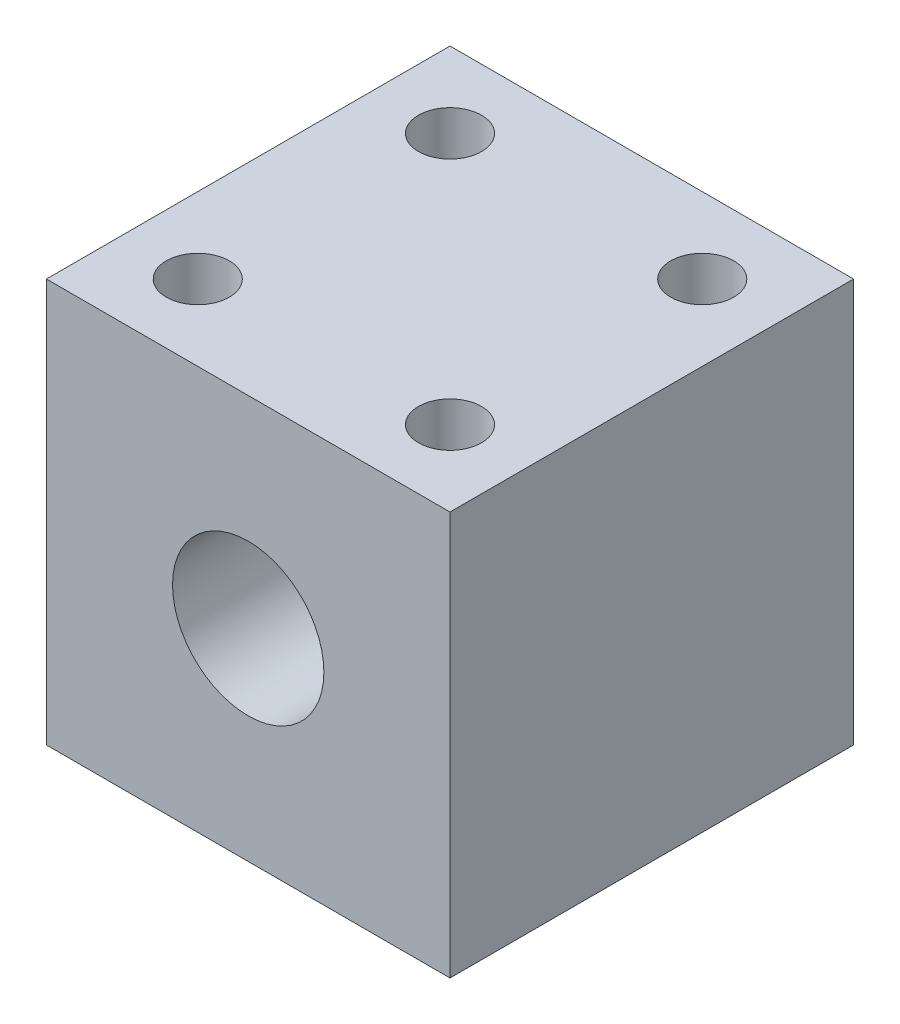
ISO-10303-21;
HEADER;
FILE_DESCRIPTION(('STEP AP214'),'2;1');
FILE_NAME('part.step','',(''),(''),'','','');
FILE_SCHEMA(('AUTOMOTIVE_DESIGN { 1 0 10303 214 1 1 1 1 }'));
ENDSEC;
DATA;
#1=APPLICATION_CONTEXT('core data for automotive mechanical design processes');
#2=APPLICATION_PROTOCOL_DEFINITION('international standard','automotive_design',2000,#1);
#3=PRODUCT_CONTEXT('',#1,'mechanical');
#4=PRODUCT('Part','Part','',(#3));
#5=PRODUCT_RELATED_PRODUCT_CATEGORY('part','',(#4));
#6=PRODUCT_DEFINITION_FORMATION('','',#4);
#7=PRODUCT_DEFINITION_CONTEXT('part definition',#1,'design');
#8=PRODUCT_DEFINITION('design','',#6,#7);
#9=PRODUCT_DEFINITION_SHAPE('','',#8);
#10=(LENGTH_UNIT() NAMED_UNIT(*) SI_UNIT(.MILLI.,.METRE.));
#11=(NAMED_UNIT(*) PLANE_ANGLE_UNIT() SI_UNIT($,.RADIAN.));
#12=(NAMED_UNIT(*) SI_UNIT($,.STERADIAN.) SOLID_ANGLE_UNIT());
#13=UNCERTAINTY_MEASURE_WITH_UNIT(LENGTH_MEASURE(1.E-05),#10,'distance_accuracy_value','');
#14=(GEOMETRIC_REPRESENTATION_CONTEXT(3) GLOBAL_UNCERTAINTY_ASSIGNED_CONTEXT((#13)) GLOBAL_UNIT_ASSIGNED_CONTEXT((#10,
#11,#12)) REPRESENTATION_CONTEXT('',''));
#15=CARTESIAN_POINT('',(0.,0.,0.));
#16=DIRECTION('',(0.,0.,1.));
#17=DIRECTION('',(1.,0.,0.));
#18=AXIS2_PLACEMENT_3D('',#15,#16,#17);
#19=CARTESIAN_POINT('',(8.,-8.,16.));
#20=DIRECTION('',(-1.,0.,0.));
#21=DIRECTION('',(0.,0.,1.));
#22=AXIS2_PLACEMENT_3D('',#19,#20,#21);
#23=PLANE('',#22);
#24=DIRECTION('',(0.,1.,0.));
#25=VECTOR('',#24,1.);
#26=CARTESIAN_POINT('',(8.,-8.,0.));
#27=LINE('',#26,#25);
#28=CARTESIAN_POINT('',(8.,-8.,0.));
#29=VERTEX_POINT('',#28);
#30=CARTESIAN_POINT('',(8.,8.,0.));
#31=VERTEX_POINT('',#30);
#32=EDGE_CURVE('E101',#29,#31,#27,.T.);
#33=ORIENTED_EDGE('',*,*,#32,.T.);
#34=DIRECTION('',(0.,0.,-1.));
#35=VECTOR('',#34,1.);
#36=CARTESIAN_POINT('',(8.,8.,16.));
#37=LINE('',#36,#35);
#38=CARTESIAN_POINT('',(8.,8.,16.));
#39=VERTEX_POINT('',#38);
#40=EDGE_CURVE('E11',#39,#31,#37,.T.);
#41=ORIENTED_EDGE('',*,*,#40,.F.);
#42=DIRECTION('',(0.,1.,0.));
#43=VECTOR('',#42,1.);
#44=CARTESIAN_POINT('',(8.,-8.,16.));
#45=LINE('',#44,#43);
#46=CARTESIAN_POINT('',(8.,-8.,16.));
#47=VERTEX_POINT('',#46);
#48=EDGE_CURVE('E89',#47,#39,#45,.T.);
#49=ORIENTED_EDGE('',*,*,#48,.F.);
#50=DIRECTION('',(0.,0.,-1.));
#51=VECTOR('',#50,1.);
#52=CARTESIAN_POINT('',(8.,-8.,16.));
#53=LINE('',#52,#51);
#54=EDGE_CURVE('E97',#47,#29,#53,.T.);
#55=ORIENTED_EDGE('',*,*,#54,.T.);
#56=EDGE_LOOP('',(#33,#41,#49,#55));
#57=FACE_BOUND('',#56,.T.);
#58=ADVANCED_FACE('F38',(#57),#23,.F.);
#59=CARTESIAN_POINT('',(-8.,8.,16.));
#60=DIRECTION('',(0.,-1.,0.));
#61=DIRECTION('',(0.,0.,-1.));
#62=AXIS2_PLACEMENT_3D('',#59,#60,#61);
#63=PLANE('',#62);
#64=CARTESIAN_POINT('',(-5.,8.00000000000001,3.));
#65=DIRECTION('',(0.,1.,0.));
#66=DIRECTION('',(0.,0.,1.));
#67=AXIS2_PLACEMENT_3D('',#64,#65,#66);
#68=CIRCLE('',#67,1.24999999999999);
#69=CARTESIAN_POINT('',(-5.,8.00000000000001,4.24999999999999));
#70=VERTEX_POINT('',#69);
#71=EDGE_CURVE('E141',#70,#70,#68,.T.);
#72=ORIENTED_EDGE('',*,*,#71,.F.);
#73=EDGE_LOOP('',(#72));
#74=FACE_BOUND('',#73,.T.);
#75=CARTESIAN_POINT('',(5.,8.00000000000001,3.));
#76=DIRECTION('',(0.,1.,0.));
#77=DIRECTION('',(0.,0.,1.));
#78=AXIS2_PLACEMENT_3D('',#75,#76,#77);
#79=CIRCLE('',#78,1.24999999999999);
#80=CARTESIAN_POINT('',(5.,8.00000000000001,4.24999999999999));
#81=VERTEX_POINT('',#80);
#82=EDGE_CURVE('E135',#81,#81,#79,.T.);
#83=ORIENTED_EDGE('',*,*,#82,.F.);
#84=EDGE_LOOP('',(#83));
#85=FACE_BOUND('',#84,.T.);
#86=CARTESIAN_POINT('',(5.,8.00000000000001,13.));
#87=DIRECTION('',(0.,1.,0.));
#88=DIRECTION('',(0.,0.,1.));
#89=AXIS2_PLACEMENT_3D('',#86,#87,#88);
#90=CIRCLE('',#89,1.24999999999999);
#91=CARTESIAN_POINT('',(5.,8.00000000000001,14.25));
#92=VERTEX_POINT('',#91);
#93=EDGE_CURVE('E129',#92,#92,#90,.T.);
#94=ORIENTED_EDGE('',*,*,#93,.F.);
#95=EDGE_LOOP('',(#94));
#96=FACE_BOUND('',#95,.T.);
#97=CARTESIAN_POINT('',(-5.,8.00000000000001,13.));
#98=DIRECTION('',(0.,1.,0.));
#99=DIRECTION('',(0.,0.,1.));
#100=AXIS2_PLACEMENT_3D('',#97,#98,#99);
#101=CIRCLE('',#100,1.24999999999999);
#102=CARTESIAN_POINT('',(-5.,8.00000000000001,14.25));
#103=VERTEX_POINT('',#102);
#104=EDGE_CURVE('E123',#103,#103,#101,.T.);
#105=ORIENTED_EDGE('',*,*,#104,.F.);
#106=EDGE_LOOP('',(#105));
#107=FACE_BOUND('',#106,.T.);
#108=DIRECTION('',(-1.,0.,0.));
#109=VECTOR('',#108,1.);
#110=CARTESIAN_POINT('',(-8.,8.,0.));
#111=LINE('',#110,#109);
#112=CARTESIAN_POINT('',(-8.,8.,0.));
#113=VERTEX_POINT('',#112);
#114=EDGE_CURVE('E93',#31,#113,#111,.T.);
#115=ORIENTED_EDGE('',*,*,#114,.T.);
#116=DIRECTION('',(0.,0.,-1.));
#117=VECTOR('',#116,1.);
#118=CARTESIAN_POINT('',(-8.,8.,16.));
#119=LINE('',#118,#117);
#120=CARTESIAN_POINT('',(-8.,8.,16.));
#121=VERTEX_POINT('',#120);
#122=EDGE_CURVE('E46',#121,#113,#119,.T.);
#123=ORIENTED_EDGE('',*,*,#122,.F.);
#124=DIRECTION('',(-1.,0.,0.));
#125=VECTOR('',#124,1.);
#126=CARTESIAN_POINT('',(-8.,8.,16.));
#127=LINE('',#126,#125);
#128=EDGE_CURVE('E84',#39,#121,#127,.T.);
#129=ORIENTED_EDGE('',*,*,#128,.F.);
#130=ORIENTED_EDGE('',*,*,#40,.T.);
#131=EDGE_LOOP('',(#115,#123,#129,#130));
#132=FACE_BOUND('',#131,.T.);
#133=ADVANCED_FACE('F92',(#74,#85,#96,#107,#132),#63,.F.);
#134=CARTESIAN_POINT('',(-8.,-8.,16.));
#135=DIRECTION('',(1.,0.,0.));
#136=DIRECTION('',(0.,0.,-1.));
#137=AXIS2_PLACEMENT_3D('',#134,#135,#136);
#138=PLANE('',#137);
#139=DIRECTION('',(0.,-1.,0.));
#140=VECTOR('',#139,1.);
#141=CARTESIAN_POINT('',(-8.,-8.,0.));
#142=LINE('',#141,#140);
#143=CARTESIAN_POINT('',(-8.,-8.,0.));
#144=VERTEX_POINT('',#143);
#145=EDGE_CURVE('E71',#113,#144,#142,.T.);
#146=ORIENTED_EDGE('',*,*,#145,.T.);
#147=DIRECTION('',(0.,0.,-1.));
#148=VECTOR('',#147,1.);
#149=CARTESIAN_POINT('',(-8.,-8.,16.));
#150=LINE('',#149,#148);
#151=CARTESIAN_POINT('',(-8.,-8.,16.));
#152=VERTEX_POINT('',#151);
#153=EDGE_CURVE('E94',#152,#144,#150,.T.);
#154=ORIENTED_EDGE('',*,*,#153,.F.);
#155=DIRECTION('',(0.,-1.,0.));
#156=VECTOR('',#155,1.);
#157=CARTESIAN_POINT('',(-8.,-8.,16.));
#158=LINE('',#157,#156);
#159=EDGE_CURVE('E87',#121,#152,#158,.T.);
#160=ORIENTED_EDGE('',*,*,#159,.F.);
#161=ORIENTED_EDGE('',*,*,#122,.T.);
#162=EDGE_LOOP('',(#146,#154,#160,#161));
#163=FACE_BOUND('',#162,.T.);
#164=ADVANCED_FACE('F95',(#163),#138,.F.);
#165=CARTESIAN_POINT('',(-8.,-8.,16.));
#166=DIRECTION('',(0.,1.,0.));
#167=DIRECTION('',(0.,0.,1.));
#168=AXIS2_PLACEMENT_3D('',#165,#166,#167);
#169=PLANE('',#168);
#170=CARTESIAN_POINT('',(-5.,-8.,3.));
#171=DIRECTION('',(0.,1.,0.));
#172=DIRECTION('',(0.,0.,1.));
#173=AXIS2_PLACEMENT_3D('',#170,#171,#172);
#174=CIRCLE('',#173,1.24999999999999);
#175=CARTESIAN_POINT('',(-5.,-8.,4.24999999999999));
#176=VERTEX_POINT('',#175);
#177=EDGE_CURVE('E138',#176,#176,#174,.T.);
#178=ORIENTED_EDGE('',*,*,#177,.T.);
#179=EDGE_LOOP('',(#178));
#180=FACE_BOUND('',#179,.T.);
#181=CARTESIAN_POINT('',(5.,-8.,3.));
#182=DIRECTION('',(0.,1.,0.));
#183=DIRECTION('',(0.,0.,1.));
#184=AXIS2_PLACEMENT_3D('',#181,#182,#183);
#185=CIRCLE('',#184,1.24999999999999);
#186=CARTESIAN_POINT('',(5.,-8.,4.24999999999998));
#187=VERTEX_POINT('',#186);
#188=EDGE_CURVE('E132',#187,#187,#185,.T.);
#189=ORIENTED_EDGE('',*,*,#188,.T.);
#190=EDGE_LOOP('',(#189));
#191=FACE_BOUND('',#190,.T.);
#192=CARTESIAN_POINT('',(5.,-8.,13.));
#193=DIRECTION('',(0.,1.,0.));
#194=DIRECTION('',(0.,0.,1.));
#195=AXIS2_PLACEMENT_3D('',#192,#193,#194);
#196=CIRCLE('',#195,1.24999999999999);
#197=CARTESIAN_POINT('',(5.,-8.,14.25));
#198=VERTEX_POINT('',#197);
#199=EDGE_CURVE('E126',#198,#198,#196,.T.);
#200=ORIENTED_EDGE('',*,*,#199,.T.);
#201=EDGE_LOOP('',(#200));
#202=FACE_BOUND('',#201,.T.);
#203=CARTESIAN_POINT('',(-5.,-8.,13.));
#204=DIRECTION('',(0.,1.,0.));
#205=DIRECTION('',(0.,0.,1.));
#206=AXIS2_PLACEMENT_3D('',#203,#204,#205);
#207=CIRCLE('',#206,1.24999999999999);
#208=CARTESIAN_POINT('',(-5.,-8.,14.25));
#209=VERTEX_POINT('',#208);
#210=EDGE_CURVE('E118',#209,#209,#207,.T.);
#211=ORIENTED_EDGE('',*,*,#210,.T.);
#212=EDGE_LOOP('',(#211));
#213=FACE_BOUND('',#212,.T.);
#214=DIRECTION('',(1.,0.,0.));
#215=VECTOR('',#214,1.);
#216=CARTESIAN_POINT('',(-8.,-8.,0.));
#217=LINE('',#216,#215);
#218=EDGE_CURVE('E77',#144,#29,#217,.T.);
#219=ORIENTED_EDGE('',*,*,#218,.T.);
#220=ORIENTED_EDGE('',*,*,#54,.F.);
#221=DIRECTION('',(1.,0.,0.));
#222=VECTOR('',#221,1.);
#223=CARTESIAN_POINT('',(-8.,-8.,16.));
#224=LINE('',#223,#222);
#225=EDGE_CURVE('E54',#152,#47,#224,.T.);
#226=ORIENTED_EDGE('',*,*,#225,.F.);
#227=ORIENTED_EDGE('',*,*,#153,.T.);
#228=EDGE_LOOP('',(#219,#220,#226,#227));
#229=FACE_BOUND('',#228,.T.);
#230=ADVANCED_FACE('F109',(#180,#191,#202,#213,#229),#169,.F.);
#231=CARTESIAN_POINT('',(0.,0.,16.));
#232=DIRECTION('',(0.,0.,-1.));
#233=DIRECTION('',(-1.,0.,0.));
#234=AXIS2_PLACEMENT_3D('',#231,#232,#233);
#235=PLANE('',#234);
#236=CARTESIAN_POINT('',(0.,0.,16.));
#237=DIRECTION('',(0.,0.,1.));
#238=DIRECTION('',(1.,0.,0.));
#239=AXIS2_PLACEMENT_3D('',#236,#237,#238);
#240=CIRCLE('',#239,3.);
#241=CARTESIAN_POINT('',(3.,0.,16.));
#242=VERTEX_POINT('',#241);
#243=EDGE_CURVE('E115',#242,#242,#240,.T.);
#244=ORIENTED_EDGE('',*,*,#243,.F.);
#245=EDGE_LOOP('',(#244));
#246=FACE_BOUND('',#245,.T.);
#247=ORIENTED_EDGE('',*,*,#48,.T.);
#248=ORIENTED_EDGE('',*,*,#128,.T.);
#249=ORIENTED_EDGE('',*,*,#159,.T.);
#250=ORIENTED_EDGE('',*,*,#225,.T.);
#251=EDGE_LOOP('',(#247,#248,#249,#250));
#252=FACE_BOUND('',#251,.T.);
#253=ADVANCED_FACE('F85',(#246,#252),#235,.F.);
#254=CARTESIAN_POINT('',(0.,0.,0.));
#255=DIRECTION('',(0.,0.,-1.));
#256=DIRECTION('',(-1.,0.,0.));
#257=AXIS2_PLACEMENT_3D('',#254,#255,#256);
#258=PLANE('',#257);
#259=CARTESIAN_POINT('',(0.,0.,0.));
#260=DIRECTION('',(0.,0.,1.));
#261=DIRECTION('',(1.,0.,0.));
#262=AXIS2_PLACEMENT_3D('',#259,#260,#261);
#263=CIRCLE('',#262,3.);
#264=CARTESIAN_POINT('',(3.,0.,0.));
#265=VERTEX_POINT('',#264);
#266=EDGE_CURVE('E104',#265,#265,#263,.T.);
#267=ORIENTED_EDGE('',*,*,#266,.T.);
#268=EDGE_LOOP('',(#267));
#269=FACE_BOUND('',#268,.T.);
#270=ORIENTED_EDGE('',*,*,#32,.F.);
#271=ORIENTED_EDGE('',*,*,#218,.F.);
#272=ORIENTED_EDGE('',*,*,#145,.F.);
#273=ORIENTED_EDGE('',*,*,#114,.F.);
#274=EDGE_LOOP('',(#270,#271,#272,#273));
#275=FACE_BOUND('',#274,.T.);
#276=ADVANCED_FACE('F112',(#269,#275),#258,.T.);
#277=CARTESIAN_POINT('',(0.,0.,0.));
#278=DIRECTION('',(0.,0.,1.));
#279=DIRECTION('',(1.,0.,0.));
#280=AXIS2_PLACEMENT_3D('',#277,#278,#279);
#281=CYLINDRICAL_SURFACE('',#280,3.);
#282=ORIENTED_EDGE('',*,*,#266,.F.);
#283=EDGE_LOOP('',(#282));
#284=FACE_BOUND('',#283,.T.);
#285=ORIENTED_EDGE('',*,*,#243,.T.);
#286=EDGE_LOOP('',(#285));
#287=FACE_BOUND('',#286,.T.);
#288=ADVANCED_FACE('F158',(#284,#287),#281,.F.);
#289=CARTESIAN_POINT('',(-5.,8.,13.));
#290=DIRECTION('',(0.,1.,0.));
#291=DIRECTION('',(0.,0.,1.));
#292=AXIS2_PLACEMENT_3D('',#289,#290,#291);
#293=CYLINDRICAL_SURFACE('',#292,1.24999999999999);
#294=ORIENTED_EDGE('',*,*,#210,.F.);
#295=EDGE_LOOP('',(#294));
#296=FACE_BOUND('',#295,.T.);
#297=ORIENTED_EDGE('',*,*,#104,.T.);
#298=EDGE_LOOP('',(#297));
#299=FACE_BOUND('',#298,.T.);
#300=ADVANCED_FACE('F155',(#296,#299),#293,.F.);
#301=CARTESIAN_POINT('',(5.,8.,13.));
#302=DIRECTION('',(0.,1.,0.));
#303=DIRECTION('',(0.,0.,1.));
#304=AXIS2_PLACEMENT_3D('',#301,#302,#303);
#305=CYLINDRICAL_SURFACE('',#304,1.24999999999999);
#306=ORIENTED_EDGE('',*,*,#199,.F.);
#307=EDGE_LOOP('',(#306));
#308=FACE_BOUND('',#307,.T.);
#309=ORIENTED_EDGE('',*,*,#93,.T.);
#310=EDGE_LOOP('',(#309));
#311=FACE_BOUND('',#310,.T.);
#312=ADVANCED_FACE('F157',(#308,#311),#305,.F.);
#313=CARTESIAN_POINT('',(5.,8.,3.));
#314=DIRECTION('',(0.,1.,0.));
#315=DIRECTION('',(0.,0.,1.));
#316=AXIS2_PLACEMENT_3D('',#313,#314,#315);
#317=CYLINDRICAL_SURFACE('',#316,1.24999999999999);
#318=ORIENTED_EDGE('',*,*,#188,.F.);
#319=EDGE_LOOP('',(#318));
#320=FACE_BOUND('',#319,.T.);
#321=ORIENTED_EDGE('',*,*,#82,.T.);
#322=EDGE_LOOP('',(#321));
#323=FACE_BOUND('',#322,.T.);
#324=ADVANCED_FACE('F165',(#320,#323),#317,.F.);
#325=CARTESIAN_POINT('',(-5.,8.,3.));
#326=DIRECTION('',(0.,1.,0.));
#327=DIRECTION('',(0.,0.,1.));
#328=AXIS2_PLACEMENT_3D('',#325,#326,#327);
#329=CYLINDRICAL_SURFACE('',#328,1.24999999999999);
#330=ORIENTED_EDGE('',*,*,#177,.F.);
#331=EDGE_LOOP('',(#330));
#332=FACE_BOUND('',#331,.T.);
#333=ORIENTED_EDGE('',*,*,#71,.T.);
#334=EDGE_LOOP('',(#333));
#335=FACE_BOUND('',#334,.T.);
#336=ADVANCED_FACE('F145',(#332,#335),#329,.F.);
#337=CLOSED_SHELL('',(#58,#133,#164,#230,#253,#276,#288,#300,#312,#324,#336));
#338=MANIFOLD_SOLID_BREP('B2',#337);
#339=ADVANCED_BREP_SHAPE_REPRESENTATION('',(#18,#338),#14);
#340=SHAPE_DEFINITION_REPRESENTATION(#9,#339);
ENDSEC;
END-ISO-10303-21;
